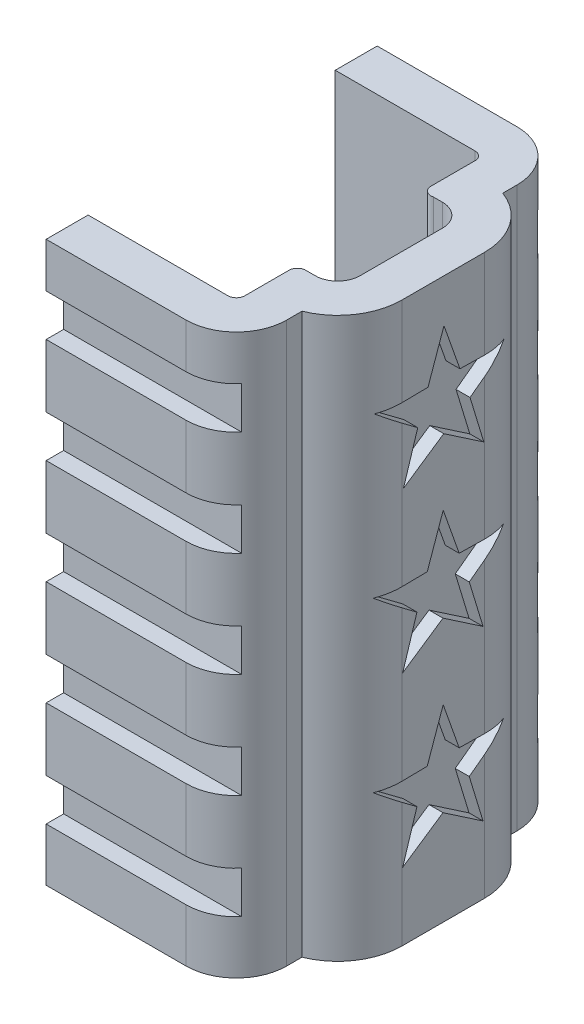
from build123d import *

# Parameters (mm, degrees)
BOSS_EXTRUDE1_DEPTH = 50.8
CUT_EXTRUDE1_DEPTH  = 1.5875
CUT_EXTRUDE2_DEPTH  = 1.27


with BuildPart() as part:
    # Sketch1 → Boss-Extrude1 (new body)
    with BuildSketch(Plane(origin=(0, 0, 0), x_dir=(1, 0, 0), z_dir=(0, 1, 0))):
        with BuildLine():
            Line((-69.609021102, 11.413302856), (-56.909021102, 11.413302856))
            ThreePointArc((-56.909021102, 11.413302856), (-56.370205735, 11.190118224), (-56.147021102, 10.651302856))
            Line((-56.147021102, 10.651302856), (-56.147021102, 6.637162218))
            ThreePointArc((-56.147021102, 6.637162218), (-55.846901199, 6.031100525), (-55.182950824, 5.902443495))
            Line((-55.182950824, 5.902443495), (-54.354385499, 5.902443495))
            ThreePointArc((-54.354385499, 5.902443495), (-52.91754452, 5.307284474), (-52.322385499, 3.870443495))
            Line((-52.322385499, 3.870443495), (-52.322385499, -3.622556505))
            ThreePointArc((-52.322385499, -3.622556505), (-52.91754452, -5.059397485), (-54.354385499, -5.654556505))
            Line((-54.354385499, -5.654556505), (-55.217985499, -5.654556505))
            ThreePointArc((-55.217985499, -5.654556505), (-55.756800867, -5.877741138), (-55.979985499, -6.416556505))
            Line((-55.979985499, -6.416556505), (-55.979985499, -10.430697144))
            ThreePointArc((-55.979985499, -10.430697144), (-56.203170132, -10.969512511), (-56.741985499, -11.192697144))
            Line((-56.741985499, -11.192697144), (-69.441985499, -11.192697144))
            Line((-69.441985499, -11.192697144), (-69.441985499, -15.002697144))
            Line((-69.441985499, -15.002697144), (-56.741985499, -15.002697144))
            ThreePointArc((-56.741985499, -15.002697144), (-53.509093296, -13.663589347), (-52.169985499, -10.430697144))
            Line((-52.169985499, -10.430697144), (-52.169985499, -9.040799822))
            ThreePointArc((-52.169985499, -9.040799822), (-49.512369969, -6.891172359), (-48.512385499, -3.622556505))
            Line((-48.512385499, -3.622556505), (-48.512385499, 3.870443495))
            ThreePointArc((-48.512385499, 3.870443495), (-49.563017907, 7.21286187), (-52.337021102, 9.353071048))
            Line((-52.337021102, 9.353071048), (-52.337021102, 10.651302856))
            ThreePointArc((-52.337021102, 10.651302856), (-53.676128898, 13.88419506), (-56.909021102, 15.223302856))
            Line((-56.909021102, 15.223302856), (-69.609021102, 15.223302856))
            Line((-69.609021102, 15.223302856), (-69.609021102, 11.413302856))
        make_face()
    extrude(amount=BOSS_EXTRUDE1_DEPTH)

    # Sketch5 → Cut-Extrude1 (cut)
    with BuildSketch(Plane.XY.offset(15.002697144)):
        with BuildLine():
            Line((-71.799815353, 46.731370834), (-50.027949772, 46.731370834))
            ThreePointArc((-50.027949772, 46.731370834), (-48.122949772, 44.826370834), (-50.027949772, 42.921370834))
            Line((-50.027949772, 42.921370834), (-71.799815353, 42.921370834))
            ThreePointArc((-71.799815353, 42.921370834), (-73.704815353, 44.826370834), (-71.799815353, 46.731370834))
        make_face()
        with BuildLine():
            Line((-71.799815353, 37.206370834), (-50.027949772, 37.206370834))
            ThreePointArc((-50.027949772, 37.206370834), (-48.122949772, 35.301370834), (-50.027949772, 33.396370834))
            Line((-50.027949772, 33.396370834), (-71.799815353, 33.396370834))
            ThreePointArc((-71.799815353, 33.396370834), (-73.704815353, 35.301370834), (-71.799815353, 37.206370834))
        make_face()
        with BuildLine():
            Line((-71.799815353, 27.681370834), (-50.027949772, 27.681370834))
            ThreePointArc((-50.027949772, 27.681370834), (-48.122949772, 25.776370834), (-50.027949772, 23.871370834))
            Line((-50.027949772, 23.871370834), (-71.799815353, 23.871370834))
            ThreePointArc((-71.799815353, 23.871370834), (-73.704815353, 25.776370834), (-71.799815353, 27.681370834))
        make_face()
        with BuildLine():
            Line((-71.799815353, 18.156370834), (-50.027949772, 18.156370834))
            ThreePointArc((-50.027949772, 18.156370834), (-48.122949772, 16.251370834), (-50.027949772, 14.346370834))
            Line((-50.027949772, 14.346370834), (-71.799815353, 14.346370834))
            ThreePointArc((-71.799815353, 14.346370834), (-73.704815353, 16.251370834), (-71.799815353, 18.156370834))
        make_face()
        with BuildLine():
            Line((-71.799815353, 8.631370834), (-50.027949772, 8.631370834))
            ThreePointArc((-50.027949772, 8.631370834), (-48.122949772, 6.726370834), (-50.027949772, 4.821370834))
            Line((-50.027949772, 4.821370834), (-71.799815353, 4.821370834))
            ThreePointArc((-71.799815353, 4.821370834), (-73.704815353, 6.726370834), (-71.799815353, 8.631370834))
        make_face()
    cut_extrude1 = extrude(amount=-CUT_EXTRUDE1_DEPTH, mode=Mode.SUBTRACT)

    # Mirror1: Cut-Extrude1 across plane
    add(cut_extrude1.mirror(Plane(origin=(0, 0, -0.110302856), x_dir=(1, 0, 0), z_dir=(0, 0, -1))), mode=Mode.SUBTRACT)

    # Sketch6 → Cut-Extrude2 (cut)
    with BuildSketch(Plane(origin=(-48.512385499, 0, 0), x_dir=(0, 0, -1), z_dir=(1, 0, 0))):
        Polygon((0.188814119, 46.870762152), (1.641026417, 42.757324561), (6.095046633, 42.675923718), (2.554778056, 40.046222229), (3.807043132, 35.920647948), (0.168590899, 38.391635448), (-3.487214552, 35.920647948), (-2.191976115, 40.046222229), (-5.734815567, 42.695171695), (-1.260281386, 42.757324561), align=None)
        Polygon((0.119635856, 32.399216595), (1.571848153, 28.285779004), (6.02586837, 28.204378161), (2.485599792, 25.574676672), (3.737864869, 21.449102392), (0.099412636, 23.920089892), (-3.556392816, 21.449102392), (-2.261154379, 25.574676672), (-5.80399383, 28.223626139), (-1.329459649, 28.285779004), align=None)
        Polygon((0.117942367, 17.102788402), (1.570154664, 12.989350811), (6.024174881, 12.907949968), (2.483906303, 10.278248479), (3.73617138, 6.152674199), (0.097719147, 8.623661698), (-3.558086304, 6.152674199), (-2.262847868, 10.278248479), (-5.805687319, 12.927197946), (-1.331153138, 12.989350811), align=None)
    extrude(amount=-CUT_EXTRUDE2_DEPTH, mode=Mode.SUBTRACT)


solid = part.part
